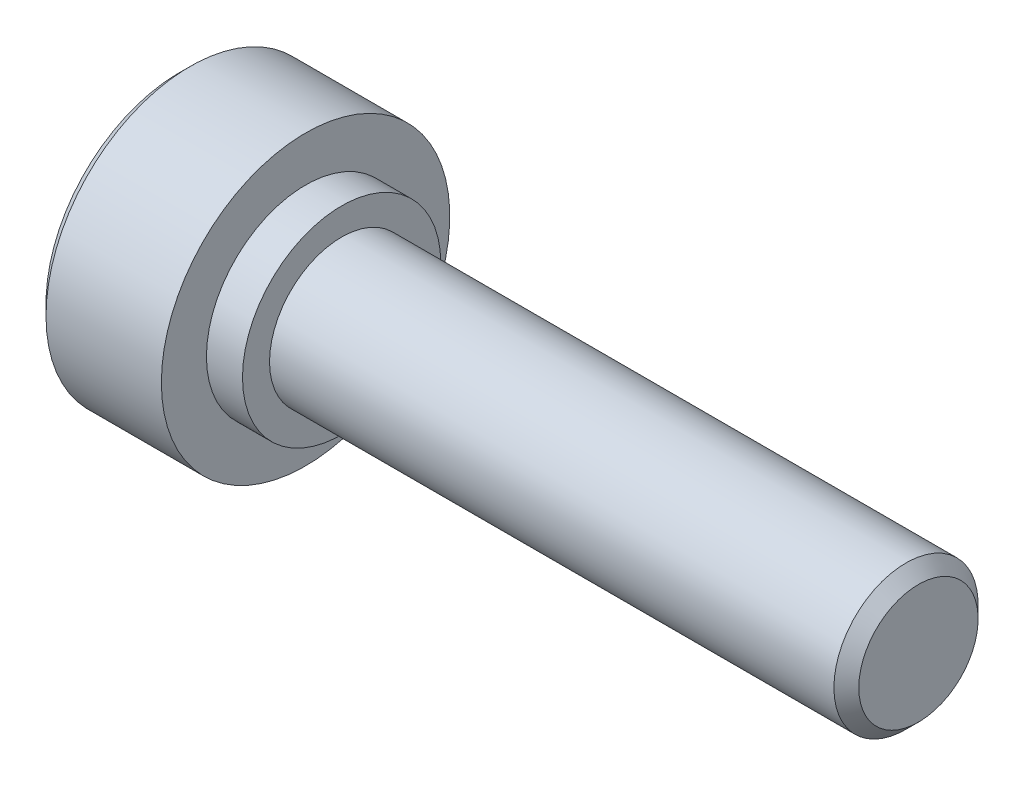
from build123d import *

# Parameters (mm, degrees)
CHAMFER1_SIZE = 0.6
HEX_2_DEPTH   = 4.2


with BuildPart() as part:
    # BodySke → BaseBody (revolve)
    with BuildSketch(Plane.XY, mode=Mode.PRIVATE) as basebody_sk:
        Polygon((0, 0), (0, 8), (7, 8), (7, 5.5), (9, 5.5), (9, 4), (40.3095, 4), (41, 3.3095), (41, 0), align=None)
    revolve(basebody_sk.sketch.rotate(Axis((-6.35, 0, 0), (1, 0, 0)), 90), axis=Axis((-6.35, 0, 0), (1, 0, 0)))

    # Chamfer1
    chamfer1_edges = [part.edges().sort_by_distance(p)[0] for p in [
        (0, 0, -8),
    ]]
    chamfer(chamfer1_edges, length=CHAMFER1_SIZE)

    # Sketch2 → PreBroach (revolve, cut)
    with BuildSketch(Plane.XY, mode=Mode.PRIVATE) as prebroach_sk:
        Polygon((0, 3), (4.2, 3), (5.932050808, 0), (0, 0), align=None)
    revolve(prebroach_sk.sketch.rotate(Axis((0, 0, 0), (1, 0, 0)), 90), axis=Axis((0, 0, 0), (1, 0, 0)), mode=Mode.SUBTRACT)

    # Sketch3 → Hex 2 (cut)
    with BuildSketch(Plane.ZY):
        Polygon((-3, -1.732050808), (-3, 1.732050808), (0, 3.464101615), (3, 1.732050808), (3, -1.732050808), (0, -3.464101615), align=None)
    extrude(amount=-HEX_2_DEPTH, mode=Mode.SUBTRACT)


solid = part.part
